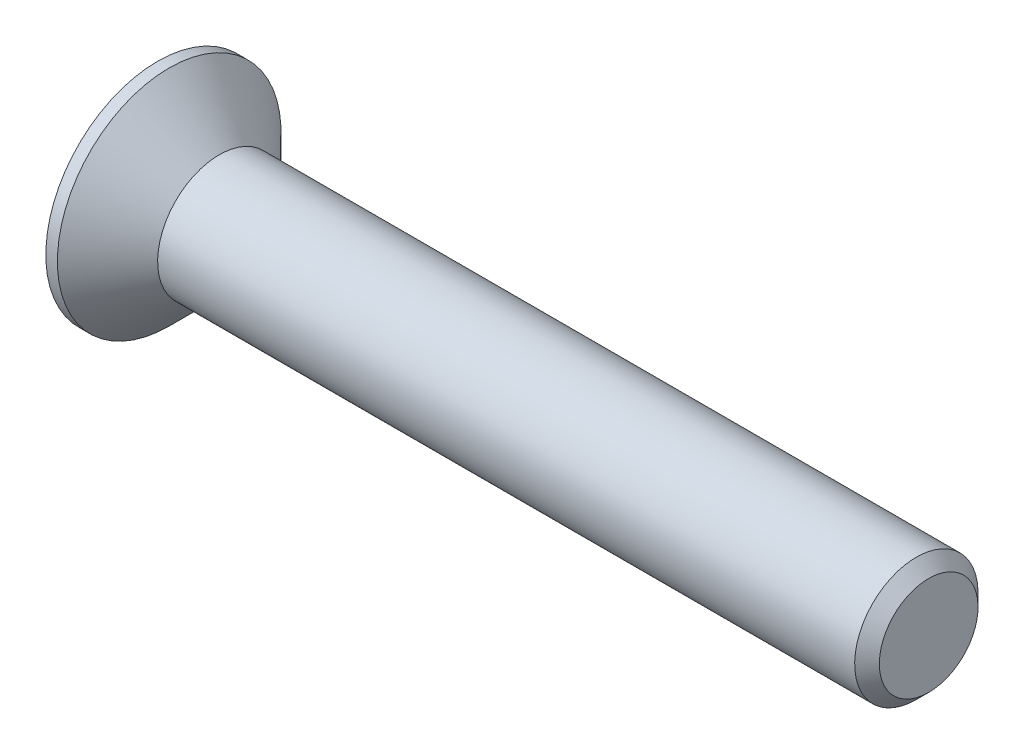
ISO-10303-21;
HEADER;
FILE_DESCRIPTION(('STEP AP214'),'2;1');
FILE_NAME('part.step','',(''),(''),'','','');
FILE_SCHEMA(('AUTOMOTIVE_DESIGN { 1 0 10303 214 1 1 1 1 }'));
ENDSEC;
DATA;
#1=APPLICATION_CONTEXT('core data for automotive mechanical design processes');
#2=APPLICATION_PROTOCOL_DEFINITION('international standard','automotive_design',2000,#1);
#3=PRODUCT_CONTEXT('',#1,'mechanical');
#4=PRODUCT('Part','Part','',(#3));
#5=PRODUCT_RELATED_PRODUCT_CATEGORY('part','',(#4));
#6=PRODUCT_DEFINITION_FORMATION('','',#4);
#7=PRODUCT_DEFINITION_CONTEXT('part definition',#1,'design');
#8=PRODUCT_DEFINITION('design','',#6,#7);
#9=PRODUCT_DEFINITION_SHAPE('','',#8);
#10=(LENGTH_UNIT() NAMED_UNIT(*) SI_UNIT(.MILLI.,.METRE.));
#11=(NAMED_UNIT(*) PLANE_ANGLE_UNIT() SI_UNIT($,.RADIAN.));
#12=(NAMED_UNIT(*) SI_UNIT($,.STERADIAN.) SOLID_ANGLE_UNIT());
#13=UNCERTAINTY_MEASURE_WITH_UNIT(LENGTH_MEASURE(1.E-05),#10,'distance_accuracy_value','');
#14=(GEOMETRIC_REPRESENTATION_CONTEXT(3) GLOBAL_UNCERTAINTY_ASSIGNED_CONTEXT((#13)) GLOBAL_UNIT_ASSIGNED_CONTEXT((#10,
#11,#12)) REPRESENTATION_CONTEXT('',''));
#15=CARTESIAN_POINT('',(0.,0.,0.));
#16=DIRECTION('',(0.,0.,1.));
#17=DIRECTION('',(1.,0.,0.));
#18=AXIS2_PLACEMENT_3D('',#15,#16,#17);
#19=CARTESIAN_POINT('',(0.,0.,0.));
#20=DIRECTION('',(-1.,0.,0.));
#21=DIRECTION('',(0.,-1.,0.));
#22=AXIS2_PLACEMENT_3D('',#19,#20,#21);
#23=CONICAL_SURFACE('',#22,4.,0.78539816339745);
#24=CARTESIAN_POINT('',(-3.24999999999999,0.,0.));
#25=DIRECTION('',(-1.,0.,0.));
#26=DIRECTION('',(0.,-1.,0.));
#27=AXIS2_PLACEMENT_3D('',#24,#25,#26);
#28=CIRCLE('',#27,7.25);
#29=CARTESIAN_POINT('',(-3.24999999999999,-7.25,0.));
#30=VERTEX_POINT('',#29);
#31=EDGE_CURVE('E189',#30,#30,#28,.T.);
#32=ORIENTED_EDGE('',*,*,#31,.F.);
#33=EDGE_LOOP('',(#32));
#34=FACE_BOUND('',#33,.T.);
#35=CARTESIAN_POINT('',(0.,0.,0.));
#36=DIRECTION('',(-1.,0.,0.));
#37=DIRECTION('',(0.,-1.,0.));
#38=AXIS2_PLACEMENT_3D('',#35,#36,#37);
#39=CIRCLE('',#38,4.);
#40=CARTESIAN_POINT('',(0.,-4.,0.));
#41=VERTEX_POINT('',#40);
#42=EDGE_CURVE('E212',#41,#41,#39,.T.);
#43=ORIENTED_EDGE('',*,*,#42,.T.);
#44=EDGE_LOOP('',(#43));
#45=FACE_BOUND('',#44,.T.);
#46=ADVANCED_FACE('F33',(#34,#45),#23,.T.);
#47=CARTESIAN_POINT('',(-4.,0.,0.));
#48=DIRECTION('',(-1.,0.,0.));
#49=DIRECTION('',(0.,-1.,0.));
#50=AXIS2_PLACEMENT_3D('',#47,#48,#49);
#51=CYLINDRICAL_SURFACE('',#50,4.);
#52=CARTESIAN_POINT('',(45.2,0.,0.));
#53=DIRECTION('',(-1.,0.,0.));
#54=DIRECTION('',(0.,-1.,0.));
#55=AXIS2_PLACEMENT_3D('',#52,#53,#54);
#56=CIRCLE('',#55,4.);
#57=CARTESIAN_POINT('',(45.2,-4.,0.));
#58=VERTEX_POINT('',#57);
#59=EDGE_CURVE('E41',#58,#58,#56,.T.);
#60=ORIENTED_EDGE('',*,*,#59,.T.);
#61=EDGE_LOOP('',(#60));
#62=FACE_BOUND('',#61,.T.);
#63=ORIENTED_EDGE('',*,*,#42,.F.);
#64=EDGE_LOOP('',(#63));
#65=FACE_BOUND('',#64,.T.);
#66=ADVANCED_FACE('F217',(#62,#65),#51,.T.);
#67=CARTESIAN_POINT('',(46.,0.,0.));
#68=DIRECTION('',(-1.,0.,0.));
#69=DIRECTION('',(0.,-1.,0.));
#70=AXIS2_PLACEMENT_3D('',#67,#68,#69);
#71=PLANE('',#70);
#72=CARTESIAN_POINT('',(46.,0.,0.));
#73=DIRECTION('',(-1.,0.,0.));
#74=DIRECTION('',(0.,-1.,0.));
#75=AXIS2_PLACEMENT_3D('',#72,#73,#74);
#76=CIRCLE('',#75,3.2);
#77=CARTESIAN_POINT('',(46.,-3.2,0.));
#78=VERTEX_POINT('',#77);
#79=EDGE_CURVE('E11',#78,#78,#76,.F.);
#80=ORIENTED_EDGE('',*,*,#79,.T.);
#81=EDGE_LOOP('',(#80));
#82=FACE_BOUND('',#81,.T.);
#83=ADVANCED_FACE('F239',(#82),#71,.F.);
#84=CARTESIAN_POINT('',(-4.,7.25,0.));
#85=DIRECTION('',(1.,0.,0.));
#86=DIRECTION('',(0.,1.,0.));
#87=AXIS2_PLACEMENT_3D('',#84,#85,#86);
#88=PLANE('',#87);
#89=DIRECTION('',(0.,0.,-1.));
#90=VECTOR('',#89,1.);
#91=CARTESIAN_POINT('',(-4.,1.09,-4.35));
#92=LINE('',#91,#90);
#93=CARTESIAN_POINT('',(-4.,1.09,-1.09));
#94=VERTEX_POINT('',#93);
#95=CARTESIAN_POINT('',(-4.,1.09,-4.35));
#96=VERTEX_POINT('',#95);
#97=EDGE_CURVE('E158',#94,#96,#92,.T.);
#98=ORIENTED_EDGE('',*,*,#97,.F.);
#99=DIRECTION('',(0.,-1.,0.));
#100=VECTOR('',#99,1.);
#101=CARTESIAN_POINT('',(-4.,1.09,-1.09));
#102=LINE('',#101,#100);
#103=CARTESIAN_POINT('',(-4.,4.35,-1.09));
#104=VERTEX_POINT('',#103);
#105=EDGE_CURVE('E48',#104,#94,#102,.T.);
#106=ORIENTED_EDGE('',*,*,#105,.F.);
#107=DIRECTION('',(0.,0.,-1.));
#108=VECTOR('',#107,1.);
#109=CARTESIAN_POINT('',(-4.,4.35,-1.09));
#110=LINE('',#109,#108);
#111=CARTESIAN_POINT('',(-4.,4.35,1.09));
#112=VERTEX_POINT('',#111);
#113=EDGE_CURVE('E185',#112,#104,#110,.T.);
#114=ORIENTED_EDGE('',*,*,#113,.F.);
#115=DIRECTION('',(0.,1.,0.));
#116=VECTOR('',#115,1.);
#117=CARTESIAN_POINT('',(-4.,4.35,1.09));
#118=LINE('',#117,#116);
#119=CARTESIAN_POINT('',(-4.,1.09,1.09));
#120=VERTEX_POINT('',#119);
#121=EDGE_CURVE('E183',#120,#112,#118,.T.);
#122=ORIENTED_EDGE('',*,*,#121,.F.);
#123=DIRECTION('',(0.,0.,-1.));
#124=VECTOR('',#123,1.);
#125=CARTESIAN_POINT('',(-4.,1.09,1.09));
#126=LINE('',#125,#124);
#127=CARTESIAN_POINT('',(-4.,1.09,4.35));
#128=VERTEX_POINT('',#127);
#129=EDGE_CURVE('E132',#128,#120,#126,.T.);
#130=ORIENTED_EDGE('',*,*,#129,.F.);
#131=DIRECTION('',(0.,1.,0.));
#132=VECTOR('',#131,1.);
#133=CARTESIAN_POINT('',(-4.,1.09,4.35));
#134=LINE('',#133,#132);
#135=CARTESIAN_POINT('',(-4.,-1.09,4.35));
#136=VERTEX_POINT('',#135);
#137=EDGE_CURVE('E179',#136,#128,#134,.T.);
#138=ORIENTED_EDGE('',*,*,#137,.F.);
#139=DIRECTION('',(0.,0.,1.));
#140=VECTOR('',#139,1.);
#141=CARTESIAN_POINT('',(-4.,-1.09,4.35));
#142=LINE('',#141,#140);
#143=CARTESIAN_POINT('',(-4.,-1.09,1.09));
#144=VERTEX_POINT('',#143);
#145=EDGE_CURVE('E176',#144,#136,#142,.T.);
#146=ORIENTED_EDGE('',*,*,#145,.F.);
#147=DIRECTION('',(0.,1.,0.));
#148=VECTOR('',#147,1.);
#149=CARTESIAN_POINT('',(-4.,-1.09,1.09));
#150=LINE('',#149,#148);
#151=CARTESIAN_POINT('',(-4.,-4.35,1.09));
#152=VERTEX_POINT('',#151);
#153=EDGE_CURVE('E173',#152,#144,#150,.T.);
#154=ORIENTED_EDGE('',*,*,#153,.F.);
#155=DIRECTION('',(0.,0.,1.));
#156=VECTOR('',#155,1.);
#157=CARTESIAN_POINT('',(-4.,-4.35,1.09));
#158=LINE('',#157,#156);
#159=CARTESIAN_POINT('',(-4.,-4.35,-1.09));
#160=VERTEX_POINT('',#159);
#161=EDGE_CURVE('E170',#160,#152,#158,.T.);
#162=ORIENTED_EDGE('',*,*,#161,.F.);
#163=DIRECTION('',(0.,-1.,0.));
#164=VECTOR('',#163,1.);
#165=CARTESIAN_POINT('',(-4.,-4.35,-1.09));
#166=LINE('',#165,#164);
#167=CARTESIAN_POINT('',(-4.,-1.09,-1.09));
#168=VERTEX_POINT('',#167);
#169=EDGE_CURVE('E167',#168,#160,#166,.T.);
#170=ORIENTED_EDGE('',*,*,#169,.F.);
#171=DIRECTION('',(0.,0.,1.));
#172=VECTOR('',#171,1.);
#173=CARTESIAN_POINT('',(-4.,-1.09,-1.09));
#174=LINE('',#173,#172);
#175=CARTESIAN_POINT('',(-4.,-1.09,-4.35));
#176=VERTEX_POINT('',#175);
#177=EDGE_CURVE('E164',#176,#168,#174,.T.);
#178=ORIENTED_EDGE('',*,*,#177,.F.);
#179=DIRECTION('',(0.,-1.,0.));
#180=VECTOR('',#179,1.);
#181=CARTESIAN_POINT('',(-4.,-1.09,-4.35));
#182=LINE('',#181,#180);
#183=EDGE_CURVE('E161',#96,#176,#182,.T.);
#184=ORIENTED_EDGE('',*,*,#183,.F.);
#185=EDGE_LOOP('',(#98,#106,#114,#122,#130,#138,#146,#154,#162,#170,#178,#184));
#186=FACE_BOUND('',#185,.T.);
#187=CARTESIAN_POINT('',(-4.,0.,0.));
#188=DIRECTION('',(-1.,0.,0.));
#189=DIRECTION('',(0.,-1.,0.));
#190=AXIS2_PLACEMENT_3D('',#187,#188,#189);
#191=CIRCLE('',#190,7.25);
#192=CARTESIAN_POINT('',(-4.,-7.25,0.));
#193=VERTEX_POINT('',#192);
#194=EDGE_CURVE('E209',#193,#193,#191,.T.);
#195=ORIENTED_EDGE('',*,*,#194,.T.);
#196=EDGE_LOOP('',(#195));
#197=FACE_BOUND('',#196,.T.);
#198=ADVANCED_FACE('F230',(#186,#197),#88,.F.);
#199=CARTESIAN_POINT('',(-4.,0.,0.));
#200=DIRECTION('',(-1.,0.,0.));
#201=DIRECTION('',(0.,-1.,0.));
#202=AXIS2_PLACEMENT_3D('',#199,#200,#201);
#203=CYLINDRICAL_SURFACE('',#202,7.25);
#204=ORIENTED_EDGE('',*,*,#194,.F.);
#205=EDGE_LOOP('',(#204));
#206=FACE_BOUND('',#205,.T.);
#207=ORIENTED_EDGE('',*,*,#31,.T.);
#208=EDGE_LOOP('',(#207));
#209=FACE_BOUND('',#208,.T.);
#210=ADVANCED_FACE('F222',(#206,#209),#203,.T.);
#211=CARTESIAN_POINT('',(45.2,0.,0.));
#212=DIRECTION('',(-1.,0.,0.));
#213=DIRECTION('',(0.,-1.,0.));
#214=AXIS2_PLACEMENT_3D('',#211,#212,#213);
#215=CONICAL_SURFACE('',#214,4.,0.785398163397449);
#216=ORIENTED_EDGE('',*,*,#79,.F.);
#217=EDGE_LOOP('',(#216));
#218=FACE_BOUND('',#217,.T.);
#219=ORIENTED_EDGE('',*,*,#59,.F.);
#220=EDGE_LOOP('',(#219));
#221=FACE_BOUND('',#220,.T.);
#222=ADVANCED_FACE('F35',(#218,#221),#215,.T.);
#223=CARTESIAN_POINT('',(-0.55,1.09,-1.09));
#224=DIRECTION('',(0.,0.,-1.));
#225=DIRECTION('',(-1.,0.,0.));
#226=AXIS2_PLACEMENT_3D('',#223,#224,#225);
#227=PLANE('',#226);
#228=ORIENTED_EDGE('',*,*,#105,.T.);
#229=DIRECTION('',(-1.,0.,0.));
#230=VECTOR('',#229,1.);
#231=CARTESIAN_POINT('',(-0.55,1.09,-1.09));
#232=LINE('',#231,#230);
#233=CARTESIAN_POINT('',(-0.55,1.09,-1.09));
#234=VERTEX_POINT('',#233);
#235=EDGE_CURVE('E96',#234,#94,#232,.T.);
#236=ORIENTED_EDGE('',*,*,#235,.F.);
#237=DIRECTION('',(0.,-1.,0.));
#238=VECTOR('',#237,1.);
#239=CARTESIAN_POINT('',(-0.55,1.09,-1.09));
#240=LINE('',#239,#238);
#241=CARTESIAN_POINT('',(-0.55,4.35,-1.09));
#242=VERTEX_POINT('',#241);
#243=EDGE_CURVE('E187',#242,#234,#240,.T.);
#244=ORIENTED_EDGE('',*,*,#243,.F.);
#245=DIRECTION('',(-1.,0.,0.));
#246=VECTOR('',#245,1.);
#247=CARTESIAN_POINT('',(-0.55,4.35,-1.09));
#248=LINE('',#247,#246);
#249=EDGE_CURVE('E56',#242,#104,#248,.T.);
#250=ORIENTED_EDGE('',*,*,#249,.T.);
#251=EDGE_LOOP('',(#228,#236,#244,#250));
#252=FACE_BOUND('',#251,.T.);
#253=ADVANCED_FACE('F221',(#252),#227,.F.);
#254=CARTESIAN_POINT('',(-0.55,4.35,-1.09));
#255=DIRECTION('',(0.,1.,0.));
#256=DIRECTION('',(-1.,0.,0.));
#257=AXIS2_PLACEMENT_3D('',#254,#255,#256);
#258=PLANE('',#257);
#259=ORIENTED_EDGE('',*,*,#113,.T.);
#260=ORIENTED_EDGE('',*,*,#249,.F.);
#261=DIRECTION('',(0.,0.,-1.));
#262=VECTOR('',#261,1.);
#263=CARTESIAN_POINT('',(-0.55,4.35,-1.09));
#264=LINE('',#263,#262);
#265=CARTESIAN_POINT('',(-0.55,4.35,1.09));
#266=VERTEX_POINT('',#265);
#267=EDGE_CURVE('E144',#266,#242,#264,.T.);
#268=ORIENTED_EDGE('',*,*,#267,.F.);
#269=DIRECTION('',(-1.,0.,0.));
#270=VECTOR('',#269,1.);
#271=CARTESIAN_POINT('',(-0.55,4.35,1.09));
#272=LINE('',#271,#270);
#273=EDGE_CURVE('E136',#266,#112,#272,.T.);
#274=ORIENTED_EDGE('',*,*,#273,.T.);
#275=EDGE_LOOP('',(#259,#260,#268,#274));
#276=FACE_BOUND('',#275,.T.);
#277=ADVANCED_FACE('F228',(#276),#258,.F.);
#278=CARTESIAN_POINT('',(-0.55,4.35,1.09));
#279=DIRECTION('',(0.,0.,1.));
#280=DIRECTION('',(1.,0.,0.));
#281=AXIS2_PLACEMENT_3D('',#278,#279,#280);
#282=PLANE('',#281);
#283=ORIENTED_EDGE('',*,*,#121,.T.);
#284=ORIENTED_EDGE('',*,*,#273,.F.);
#285=DIRECTION('',(0.,1.,0.));
#286=VECTOR('',#285,1.);
#287=CARTESIAN_POINT('',(-0.55,4.35,1.09));
#288=LINE('',#287,#286);
#289=CARTESIAN_POINT('',(-0.55,1.09,1.09));
#290=VERTEX_POINT('',#289);
#291=EDGE_CURVE('E140',#290,#266,#288,.T.);
#292=ORIENTED_EDGE('',*,*,#291,.F.);
#293=DIRECTION('',(-1.,0.,0.));
#294=VECTOR('',#293,1.);
#295=CARTESIAN_POINT('',(-0.55,1.09,1.09));
#296=LINE('',#295,#294);
#297=EDGE_CURVE('E125',#290,#120,#296,.T.);
#298=ORIENTED_EDGE('',*,*,#297,.T.);
#299=EDGE_LOOP('',(#283,#284,#292,#298));
#300=FACE_BOUND('',#299,.T.);
#301=ADVANCED_FACE('F141',(#300),#282,.F.);
#302=CARTESIAN_POINT('',(-0.55,1.09,1.09));
#303=DIRECTION('',(0.,1.,0.));
#304=DIRECTION('',(-1.,0.,0.));
#305=AXIS2_PLACEMENT_3D('',#302,#303,#304);
#306=PLANE('',#305);
#307=ORIENTED_EDGE('',*,*,#129,.T.);
#308=ORIENTED_EDGE('',*,*,#297,.F.);
#309=DIRECTION('',(0.,0.,-1.));
#310=VECTOR('',#309,1.);
#311=CARTESIAN_POINT('',(-0.55,1.09,1.09));
#312=LINE('',#311,#310);
#313=CARTESIAN_POINT('',(-0.55,1.09,4.35));
#314=VERTEX_POINT('',#313);
#315=EDGE_CURVE('E129',#314,#290,#312,.T.);
#316=ORIENTED_EDGE('',*,*,#315,.F.);
#317=DIRECTION('',(-1.,0.,0.));
#318=VECTOR('',#317,1.);
#319=CARTESIAN_POINT('',(-0.55,1.09,4.35));
#320=LINE('',#319,#318);
#321=EDGE_CURVE('E137',#314,#128,#320,.T.);
#322=ORIENTED_EDGE('',*,*,#321,.T.);
#323=EDGE_LOOP('',(#307,#308,#316,#322));
#324=FACE_BOUND('',#323,.T.);
#325=ADVANCED_FACE('F127',(#324),#306,.F.);
#326=CARTESIAN_POINT('',(-0.55,1.09,4.35));
#327=DIRECTION('',(0.,0.,1.));
#328=DIRECTION('',(1.,0.,0.));
#329=AXIS2_PLACEMENT_3D('',#326,#327,#328);
#330=PLANE('',#329);
#331=ORIENTED_EDGE('',*,*,#137,.T.);
#332=ORIENTED_EDGE('',*,*,#321,.F.);
#333=DIRECTION('',(0.,1.,0.));
#334=VECTOR('',#333,1.);
#335=CARTESIAN_POINT('',(-0.55,1.09,4.35));
#336=LINE('',#335,#334);
#337=CARTESIAN_POINT('',(-0.55,-1.09,4.35));
#338=VERTEX_POINT('',#337);
#339=EDGE_CURVE('E150',#338,#314,#336,.T.);
#340=ORIENTED_EDGE('',*,*,#339,.F.);
#341=DIRECTION('',(-1.,0.,0.));
#342=VECTOR('',#341,1.);
#343=CARTESIAN_POINT('',(-0.55,-1.09,4.35));
#344=LINE('',#343,#342);
#345=EDGE_CURVE('E192',#338,#136,#344,.T.);
#346=ORIENTED_EDGE('',*,*,#345,.T.);
#347=EDGE_LOOP('',(#331,#332,#340,#346));
#348=FACE_BOUND('',#347,.T.);
#349=ADVANCED_FACE('F277',(#348),#330,.F.);
#350=CARTESIAN_POINT('',(-0.55,-1.09,4.35));
#351=DIRECTION('',(0.,-1.,0.));
#352=DIRECTION('',(1.,0.,0.));
#353=AXIS2_PLACEMENT_3D('',#350,#351,#352);
#354=PLANE('',#353);
#355=ORIENTED_EDGE('',*,*,#145,.T.);
#356=ORIENTED_EDGE('',*,*,#345,.F.);
#357=DIRECTION('',(0.,0.,1.));
#358=VECTOR('',#357,1.);
#359=CARTESIAN_POINT('',(-0.55,-1.09,4.35));
#360=LINE('',#359,#358);
#361=CARTESIAN_POINT('',(-0.55,-1.09,1.09));
#362=VERTEX_POINT('',#361);
#363=EDGE_CURVE('E152',#362,#338,#360,.T.);
#364=ORIENTED_EDGE('',*,*,#363,.F.);
#365=DIRECTION('',(-1.,0.,0.));
#366=VECTOR('',#365,1.);
#367=CARTESIAN_POINT('',(-0.55,-1.09,1.09));
#368=LINE('',#367,#366);
#369=EDGE_CURVE('E194',#362,#144,#368,.T.);
#370=ORIENTED_EDGE('',*,*,#369,.T.);
#371=EDGE_LOOP('',(#355,#356,#364,#370));
#372=FACE_BOUND('',#371,.T.);
#373=ADVANCED_FACE('F273',(#372),#354,.F.);
#374=CARTESIAN_POINT('',(-0.55,-1.09,1.09));
#375=DIRECTION('',(0.,0.,1.));
#376=DIRECTION('',(1.,0.,0.));
#377=AXIS2_PLACEMENT_3D('',#374,#375,#376);
#378=PLANE('',#377);
#379=ORIENTED_EDGE('',*,*,#153,.T.);
#380=ORIENTED_EDGE('',*,*,#369,.F.);
#381=DIRECTION('',(0.,1.,0.));
#382=VECTOR('',#381,1.);
#383=CARTESIAN_POINT('',(-0.55,-1.09,1.09));
#384=LINE('',#383,#382);
#385=CARTESIAN_POINT('',(-0.55,-4.35,1.09));
#386=VERTEX_POINT('',#385);
#387=EDGE_CURVE('E422',#386,#362,#384,.T.);
#388=ORIENTED_EDGE('',*,*,#387,.F.);
#389=DIRECTION('',(-1.,0.,0.));
#390=VECTOR('',#389,1.);
#391=CARTESIAN_POINT('',(-0.55,-4.35,1.09));
#392=LINE('',#391,#390);
#393=EDGE_CURVE('E196',#386,#152,#392,.T.);
#394=ORIENTED_EDGE('',*,*,#393,.T.);
#395=EDGE_LOOP('',(#379,#380,#388,#394));
#396=FACE_BOUND('',#395,.T.);
#397=ADVANCED_FACE('F269',(#396),#378,.F.);
#398=CARTESIAN_POINT('',(-0.55,-4.35,1.09));
#399=DIRECTION('',(0.,-1.,0.));
#400=DIRECTION('',(1.,0.,0.));
#401=AXIS2_PLACEMENT_3D('',#398,#399,#400);
#402=PLANE('',#401);
#403=ORIENTED_EDGE('',*,*,#161,.T.);
#404=ORIENTED_EDGE('',*,*,#393,.F.);
#405=DIRECTION('',(0.,0.,1.));
#406=VECTOR('',#405,1.);
#407=CARTESIAN_POINT('',(-0.55,-4.35,1.09));
#408=LINE('',#407,#406);
#409=CARTESIAN_POINT('',(-0.55,-4.35,-1.09));
#410=VERTEX_POINT('',#409);
#411=EDGE_CURVE('E419',#410,#386,#408,.T.);
#412=ORIENTED_EDGE('',*,*,#411,.F.);
#413=DIRECTION('',(-1.,0.,0.));
#414=VECTOR('',#413,1.);
#415=CARTESIAN_POINT('',(-0.55,-4.35,-1.09));
#416=LINE('',#415,#414);
#417=EDGE_CURVE('E198',#410,#160,#416,.T.);
#418=ORIENTED_EDGE('',*,*,#417,.T.);
#419=EDGE_LOOP('',(#403,#404,#412,#418));
#420=FACE_BOUND('',#419,.T.);
#421=ADVANCED_FACE('F265',(#420),#402,.F.);
#422=CARTESIAN_POINT('',(-0.55,-4.35,-1.09));
#423=DIRECTION('',(0.,0.,-1.));
#424=DIRECTION('',(-1.,0.,0.));
#425=AXIS2_PLACEMENT_3D('',#422,#423,#424);
#426=PLANE('',#425);
#427=ORIENTED_EDGE('',*,*,#169,.T.);
#428=ORIENTED_EDGE('',*,*,#417,.F.);
#429=DIRECTION('',(0.,-1.,0.));
#430=VECTOR('',#429,1.);
#431=CARTESIAN_POINT('',(-0.55,-4.35,-1.09));
#432=LINE('',#431,#430);
#433=CARTESIAN_POINT('',(-0.55,-1.09,-1.09));
#434=VERTEX_POINT('',#433);
#435=EDGE_CURVE('E416',#434,#410,#432,.T.);
#436=ORIENTED_EDGE('',*,*,#435,.F.);
#437=DIRECTION('',(-1.,0.,0.));
#438=VECTOR('',#437,1.);
#439=CARTESIAN_POINT('',(-0.55,-1.09,-1.09));
#440=LINE('',#439,#438);
#441=EDGE_CURVE('E200',#434,#168,#440,.T.);
#442=ORIENTED_EDGE('',*,*,#441,.T.);
#443=EDGE_LOOP('',(#427,#428,#436,#442));
#444=FACE_BOUND('',#443,.T.);
#445=ADVANCED_FACE('F261',(#444),#426,.F.);
#446=CARTESIAN_POINT('',(-0.55,-1.09,-1.09));
#447=DIRECTION('',(0.,-1.,0.));
#448=DIRECTION('',(1.,0.,0.));
#449=AXIS2_PLACEMENT_3D('',#446,#447,#448);
#450=PLANE('',#449);
#451=ORIENTED_EDGE('',*,*,#177,.T.);
#452=ORIENTED_EDGE('',*,*,#441,.F.);
#453=DIRECTION('',(0.,0.,1.));
#454=VECTOR('',#453,1.);
#455=CARTESIAN_POINT('',(-0.55,-1.09,-1.09));
#456=LINE('',#455,#454);
#457=CARTESIAN_POINT('',(-0.55,-1.09,-4.35));
#458=VERTEX_POINT('',#457);
#459=EDGE_CURVE('E413',#458,#434,#456,.T.);
#460=ORIENTED_EDGE('',*,*,#459,.F.);
#461=DIRECTION('',(-1.,0.,0.));
#462=VECTOR('',#461,1.);
#463=CARTESIAN_POINT('',(-0.55,-1.09,-4.35));
#464=LINE('',#463,#462);
#465=EDGE_CURVE('E202',#458,#176,#464,.T.);
#466=ORIENTED_EDGE('',*,*,#465,.T.);
#467=EDGE_LOOP('',(#451,#452,#460,#466));
#468=FACE_BOUND('',#467,.T.);
#469=ADVANCED_FACE('F257',(#468),#450,.F.);
#470=CARTESIAN_POINT('',(-0.55,-1.09,-4.35));
#471=DIRECTION('',(0.,0.,-1.));
#472=DIRECTION('',(-1.,0.,0.));
#473=AXIS2_PLACEMENT_3D('',#470,#471,#472);
#474=PLANE('',#473);
#475=ORIENTED_EDGE('',*,*,#183,.T.);
#476=ORIENTED_EDGE('',*,*,#465,.F.);
#477=DIRECTION('',(0.,-1.,0.));
#478=VECTOR('',#477,1.);
#479=CARTESIAN_POINT('',(-0.55,-1.09,-4.35));
#480=LINE('',#479,#478);
#481=CARTESIAN_POINT('',(-0.55,1.09,-4.35));
#482=VERTEX_POINT('',#481);
#483=EDGE_CURVE('E408',#482,#458,#480,.T.);
#484=ORIENTED_EDGE('',*,*,#483,.F.);
#485=DIRECTION('',(-1.,0.,0.));
#486=VECTOR('',#485,1.);
#487=CARTESIAN_POINT('',(-0.55,1.09,-4.35));
#488=LINE('',#487,#486);
#489=EDGE_CURVE('E204',#482,#96,#488,.T.);
#490=ORIENTED_EDGE('',*,*,#489,.T.);
#491=EDGE_LOOP('',(#475,#476,#484,#490));
#492=FACE_BOUND('',#491,.T.);
#493=ADVANCED_FACE('F253',(#492),#474,.F.);
#494=CARTESIAN_POINT('',(-0.55,1.09,-4.35));
#495=DIRECTION('',(0.,1.,0.));
#496=DIRECTION('',(-1.,0.,0.));
#497=AXIS2_PLACEMENT_3D('',#494,#495,#496);
#498=PLANE('',#497);
#499=ORIENTED_EDGE('',*,*,#97,.T.);
#500=ORIENTED_EDGE('',*,*,#489,.F.);
#501=DIRECTION('',(0.,0.,-1.));
#502=VECTOR('',#501,1.);
#503=CARTESIAN_POINT('',(-0.55,1.09,-4.35));
#504=LINE('',#503,#502);
#505=EDGE_CURVE('E406',#234,#482,#504,.T.);
#506=ORIENTED_EDGE('',*,*,#505,.F.);
#507=ORIENTED_EDGE('',*,*,#235,.T.);
#508=EDGE_LOOP('',(#499,#500,#506,#507));
#509=FACE_BOUND('',#508,.T.);
#510=ADVANCED_FACE('F250',(#509),#498,.F.);
#511=CARTESIAN_POINT('',(-0.55,0.,0.));
#512=DIRECTION('',(1.,0.,0.));
#513=DIRECTION('',(0.,0.,-1.));
#514=AXIS2_PLACEMENT_3D('',#511,#512,#513);
#515=PLANE('',#514);
#516=ORIENTED_EDGE('',*,*,#243,.T.);
#517=ORIENTED_EDGE('',*,*,#505,.T.);
#518=ORIENTED_EDGE('',*,*,#483,.T.);
#519=ORIENTED_EDGE('',*,*,#459,.T.);
#520=ORIENTED_EDGE('',*,*,#435,.T.);
#521=ORIENTED_EDGE('',*,*,#411,.T.);
#522=ORIENTED_EDGE('',*,*,#387,.T.);
#523=ORIENTED_EDGE('',*,*,#363,.T.);
#524=ORIENTED_EDGE('',*,*,#339,.T.);
#525=ORIENTED_EDGE('',*,*,#315,.T.);
#526=ORIENTED_EDGE('',*,*,#291,.T.);
#527=ORIENTED_EDGE('',*,*,#267,.T.);
#528=EDGE_LOOP('',(#516,#517,#518,#519,#520,#521,#522,#523,#524,#525,#526,#527));
#529=FACE_BOUND('',#528,.T.);
#530=ADVANCED_FACE('F147',(#529),#515,.F.);
#531=CLOSED_SHELL('',(#46,#66,#83,#198,#210,#222,#253,#277,#301,#325,#349,#373,#397,#421,#445,
#469,#493,#510,#530));
#532=MANIFOLD_SOLID_BREP('B2',#531);
#533=ADVANCED_BREP_SHAPE_REPRESENTATION('',(#18,#532),#14);
#534=SHAPE_DEFINITION_REPRESENTATION(#9,#533);
ENDSEC;
END-ISO-10303-21;
